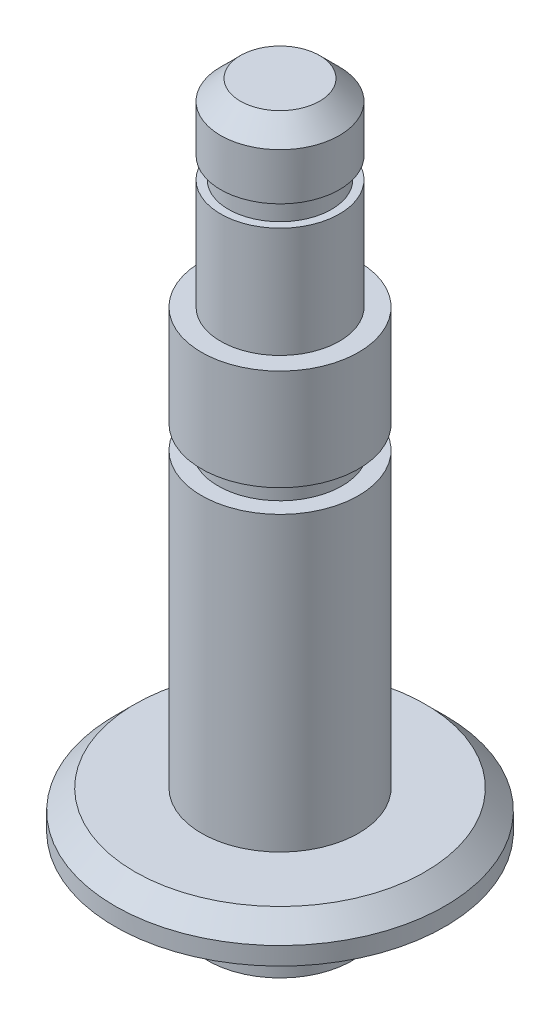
ISO-10303-21;
HEADER;
FILE_DESCRIPTION(('STEP AP214'),'2;1');
FILE_NAME('part.step','',(''),(''),'','','');
FILE_SCHEMA(('AUTOMOTIVE_DESIGN { 1 0 10303 214 1 1 1 1 }'));
ENDSEC;
DATA;
#1=APPLICATION_CONTEXT('core data for automotive mechanical design processes');
#2=APPLICATION_PROTOCOL_DEFINITION('international standard','automotive_design',2000,#1);
#3=PRODUCT_CONTEXT('',#1,'mechanical');
#4=PRODUCT('Part','Part','',(#3));
#5=PRODUCT_RELATED_PRODUCT_CATEGORY('part','',(#4));
#6=PRODUCT_DEFINITION_FORMATION('','',#4);
#7=PRODUCT_DEFINITION_CONTEXT('part definition',#1,'design');
#8=PRODUCT_DEFINITION('design','',#6,#7);
#9=PRODUCT_DEFINITION_SHAPE('','',#8);
#10=(LENGTH_UNIT() NAMED_UNIT(*) SI_UNIT(.MILLI.,.METRE.));
#11=(NAMED_UNIT(*) PLANE_ANGLE_UNIT() SI_UNIT($,.RADIAN.));
#12=(NAMED_UNIT(*) SI_UNIT($,.STERADIAN.) SOLID_ANGLE_UNIT());
#13=UNCERTAINTY_MEASURE_WITH_UNIT(LENGTH_MEASURE(1.E-05),#10,'distance_accuracy_value','');
#14=(GEOMETRIC_REPRESENTATION_CONTEXT(3) GLOBAL_UNCERTAINTY_ASSIGNED_CONTEXT((#13)) GLOBAL_UNIT_ASSIGNED_CONTEXT((#10,
#11,#12)) REPRESENTATION_CONTEXT('',''));
#15=CARTESIAN_POINT('',(0.,0.,0.));
#16=DIRECTION('',(0.,0.,1.));
#17=DIRECTION('',(1.,0.,0.));
#18=AXIS2_PLACEMENT_3D('',#15,#16,#17);
#19=CARTESIAN_POINT('',(0.,0.,0.));
#20=DIRECTION('',(0.,-1.,0.));
#21=DIRECTION('',(0.,0.,-1.));
#22=AXIS2_PLACEMENT_3D('',#19,#20,#21);
#23=CYLINDRICAL_SURFACE('',#22,2.286);
#24=CARTESIAN_POINT('',(0.,21.717,0.));
#25=DIRECTION('',(0.,-1.,0.));
#26=DIRECTION('',(0.,0.,-1.));
#27=AXIS2_PLACEMENT_3D('',#24,#25,#26);
#28=CIRCLE('',#27,2.286);
#29=CARTESIAN_POINT('',(0.,21.717,-2.286));
#30=VERTEX_POINT('',#29);
#31=EDGE_CURVE('E80',#30,#30,#28,.T.);
#32=ORIENTED_EDGE('',*,*,#31,.T.);
#33=EDGE_LOOP('',(#32));
#34=FACE_BOUND('',#33,.T.);
#35=CARTESIAN_POINT('',(0.,17.4752,0.));
#36=DIRECTION('',(0.,-1.,0.));
#37=DIRECTION('',(0.,0.,-1.));
#38=AXIS2_PLACEMENT_3D('',#35,#36,#37);
#39=CIRCLE('',#38,2.286);
#40=CARTESIAN_POINT('',(0.,17.4752,-2.286));
#41=VERTEX_POINT('',#40);
#42=EDGE_CURVE('E62',#41,#41,#39,.T.);
#43=ORIENTED_EDGE('',*,*,#42,.F.);
#44=EDGE_LOOP('',(#43));
#45=FACE_BOUND('',#44,.T.);
#46=ADVANCED_FACE('F30',(#34,#45),#23,.T.);
#47=CARTESIAN_POINT('',(0.,0.,0.));
#48=DIRECTION('',(0.,-1.,0.));
#49=DIRECTION('',(0.,0.,-1.));
#50=AXIS2_PLACEMENT_3D('',#47,#48,#49);
#51=CYLINDRICAL_SURFACE('',#50,3.0226);
#52=CARTESIAN_POINT('',(0.,12.7,0.));
#53=DIRECTION('',(0.,-1.,0.));
#54=DIRECTION('',(0.,0.,-1.));
#55=AXIS2_PLACEMENT_3D('',#52,#53,#54);
#56=CIRCLE('',#55,3.0226);
#57=CARTESIAN_POINT('',(0.,12.7,-3.0226));
#58=VERTEX_POINT('',#57);
#59=EDGE_CURVE('E68',#58,#58,#56,.T.);
#60=ORIENTED_EDGE('',*,*,#59,.T.);
#61=EDGE_LOOP('',(#60));
#62=FACE_BOUND('',#61,.T.);
#63=CARTESIAN_POINT('',(0.,1.4478,0.));
#64=DIRECTION('',(0.,-1.,0.));
#65=DIRECTION('',(0.,0.,-1.));
#66=AXIS2_PLACEMENT_3D('',#63,#64,#65);
#67=CIRCLE('',#66,3.0226);
#68=CARTESIAN_POINT('',(0.,1.4478,-3.0226));
#69=VERTEX_POINT('',#68);
#70=EDGE_CURVE('E56',#69,#69,#67,.T.);
#71=ORIENTED_EDGE('',*,*,#70,.F.);
#72=EDGE_LOOP('',(#71));
#73=FACE_BOUND('',#72,.T.);
#74=ADVANCED_FACE('F106',(#62,#73),#51,.T.);
#75=CARTESIAN_POINT('',(0.,0.,0.));
#76=DIRECTION('',(0.,-1.,0.));
#77=DIRECTION('',(0.,0.,-1.));
#78=AXIS2_PLACEMENT_3D('',#75,#76,#77);
#79=CYLINDRICAL_SURFACE('',#78,2.778125);
#80=CARTESIAN_POINT('',(0.,0.,0.));
#81=DIRECTION('',(0.,-1.,0.));
#82=DIRECTION('',(0.,0.,-1.));
#83=AXIS2_PLACEMENT_3D('',#80,#81,#82);
#84=CIRCLE('',#83,2.778125);
#85=CARTESIAN_POINT('',(0.,0.,-2.778125));
#86=VERTEX_POINT('',#85);
#87=EDGE_CURVE('E50',#86,#86,#84,.T.);
#88=ORIENTED_EDGE('',*,*,#87,.T.);
#89=EDGE_LOOP('',(#88));
#90=FACE_BOUND('',#89,.T.);
#91=CARTESIAN_POINT('',(0.,-2.921,0.));
#92=DIRECTION('',(0.,-1.,0.));
#93=DIRECTION('',(0.,0.,-1.));
#94=AXIS2_PLACEMENT_3D('',#91,#92,#93);
#95=CIRCLE('',#94,2.778125);
#96=CARTESIAN_POINT('',(0.,-2.921,-2.778125));
#97=VERTEX_POINT('',#96);
#98=EDGE_CURVE('E65',#97,#97,#95,.T.);
#99=ORIENTED_EDGE('',*,*,#98,.F.);
#100=EDGE_LOOP('',(#99));
#101=FACE_BOUND('',#100,.T.);
#102=ADVANCED_FACE('F111',(#90,#101),#79,.T.);
#103=CARTESIAN_POINT('',(0.,0.,-2.778125));
#104=DIRECTION('',(0.,-1.,0.));
#105=DIRECTION('',(0.,0.,-1.));
#106=AXIS2_PLACEMENT_3D('',#103,#104,#105);
#107=PLANE('',#106);
#108=CARTESIAN_POINT('',(0.,0.,0.));
#109=DIRECTION('',(0.,-1.,0.));
#110=DIRECTION('',(0.,0.,-1.));
#111=AXIS2_PLACEMENT_3D('',#108,#109,#110);
#112=CIRCLE('',#111,6.35);
#113=CARTESIAN_POINT('',(0.,0.,-6.35));
#114=VERTEX_POINT('',#113);
#115=EDGE_CURVE('E53',#114,#114,#112,.T.);
#116=ORIENTED_EDGE('',*,*,#115,.T.);
#117=EDGE_LOOP('',(#116));
#118=FACE_BOUND('',#117,.T.);
#119=ORIENTED_EDGE('',*,*,#87,.F.);
#120=EDGE_LOOP('',(#119));
#121=FACE_BOUND('',#120,.T.);
#122=ADVANCED_FACE('F144',(#118,#121),#107,.T.);
#123=CARTESIAN_POINT('',(0.,0.,0.));
#124=DIRECTION('',(0.,-1.,0.));
#125=DIRECTION('',(0.,0.,-1.));
#126=AXIS2_PLACEMENT_3D('',#123,#124,#125);
#127=CYLINDRICAL_SURFACE('',#126,6.35);
#128=CARTESIAN_POINT('',(0.,0.685800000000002,0.));
#129=DIRECTION('',(0.,1.,0.));
#130=DIRECTION('',(0.,0.,1.));
#131=AXIS2_PLACEMENT_3D('',#128,#129,#130);
#132=CIRCLE('',#131,6.35);
#133=CARTESIAN_POINT('',(0.,0.685800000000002,6.35));
#134=VERTEX_POINT('',#133);
#135=EDGE_CURVE('E45',#134,#134,#132,.F.);
#136=ORIENTED_EDGE('',*,*,#135,.T.);
#137=EDGE_LOOP('',(#136));
#138=FACE_BOUND('',#137,.T.);
#139=ORIENTED_EDGE('',*,*,#115,.F.);
#140=EDGE_LOOP('',(#139));
#141=FACE_BOUND('',#140,.T.);
#142=ADVANCED_FACE('F140',(#138,#141),#127,.T.);
#143=CARTESIAN_POINT('',(0.,1.4478,-6.35));
#144=DIRECTION('',(0.,1.,0.));
#145=DIRECTION('',(0.,0.,1.));
#146=AXIS2_PLACEMENT_3D('',#143,#144,#145);
#147=PLANE('',#146);
#148=CARTESIAN_POINT('',(0.,1.4478,0.));
#149=DIRECTION('',(0.,1.,0.));
#150=DIRECTION('',(0.,0.,1.));
#151=AXIS2_PLACEMENT_3D('',#148,#149,#150);
#152=CIRCLE('',#151,5.588);
#153=CARTESIAN_POINT('',(0.,1.4478,5.588));
#154=VERTEX_POINT('',#153);
#155=EDGE_CURVE('E41',#154,#154,#152,.T.);
#156=ORIENTED_EDGE('',*,*,#155,.T.);
#157=EDGE_LOOP('',(#156));
#158=FACE_BOUND('',#157,.T.);
#159=ORIENTED_EDGE('',*,*,#70,.T.);
#160=EDGE_LOOP('',(#159));
#161=FACE_BOUND('',#160,.T.);
#162=ADVANCED_FACE('F136',(#158,#161),#147,.T.);
#163=CARTESIAN_POINT('',(0.,-2.921,0.));
#164=DIRECTION('',(0.,-1.,0.));
#165=DIRECTION('',(0.,0.,-1.));
#166=AXIS2_PLACEMENT_3D('',#163,#164,#165);
#167=PLANE('',#166);
#168=ORIENTED_EDGE('',*,*,#98,.T.);
#169=EDGE_LOOP('',(#168));
#170=FACE_BOUND('',#169,.T.);
#171=ADVANCED_FACE('F139',(#170),#167,.T.);
#172=CARTESIAN_POINT('',(0.,0.685800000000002,0.));
#173=DIRECTION('',(0.,-1.,0.));
#174=DIRECTION('',(0.,0.,-1.));
#175=AXIS2_PLACEMENT_3D('',#172,#173,#174);
#176=CONICAL_SURFACE('',#175,6.35,0.78539816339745);
#177=ORIENTED_EDGE('',*,*,#155,.F.);
#178=EDGE_LOOP('',(#177));
#179=FACE_BOUND('',#178,.T.);
#180=ORIENTED_EDGE('',*,*,#135,.F.);
#181=EDGE_LOOP('',(#180));
#182=FACE_BOUND('',#181,.T.);
#183=ADVANCED_FACE('F151',(#179,#182),#176,.T.);
#184=CARTESIAN_POINT('',(0.,12.7,-3.0226));
#185=DIRECTION('',(0.,-1.,0.));
#186=DIRECTION('',(0.,0.,-1.));
#187=AXIS2_PLACEMENT_3D('',#184,#185,#186);
#188=PLANE('',#187);
#189=ORIENTED_EDGE('',*,*,#59,.F.);
#190=EDGE_LOOP('',(#189));
#191=FACE_BOUND('',#190,.T.);
#192=CARTESIAN_POINT('',(0.,12.7,0.));
#193=DIRECTION('',(0.,-1.,0.));
#194=DIRECTION('',(0.,0.,-1.));
#195=AXIS2_PLACEMENT_3D('',#192,#193,#194);
#196=CIRCLE('',#195,2.38125);
#197=CARTESIAN_POINT('',(0.,12.7,-2.38125));
#198=VERTEX_POINT('',#197);
#199=EDGE_CURVE('E71',#198,#198,#196,.T.);
#200=ORIENTED_EDGE('',*,*,#199,.T.);
#201=EDGE_LOOP('',(#200));
#202=FACE_BOUND('',#201,.T.);
#203=ADVANCED_FACE('F153',(#191,#202),#188,.F.);
#204=CARTESIAN_POINT('',(0.,0.,0.));
#205=DIRECTION('',(0.,-1.,0.));
#206=DIRECTION('',(0.,0.,-1.));
#207=AXIS2_PLACEMENT_3D('',#204,#205,#206);
#208=CYLINDRICAL_SURFACE('',#207,2.38125);
#209=ORIENTED_EDGE('',*,*,#199,.F.);
#210=EDGE_LOOP('',(#209));
#211=FACE_BOUND('',#210,.T.);
#212=CARTESIAN_POINT('',(0.,13.589,0.));
#213=DIRECTION('',(0.,-1.,0.));
#214=DIRECTION('',(0.,0.,-1.));
#215=AXIS2_PLACEMENT_3D('',#212,#213,#214);
#216=CIRCLE('',#215,2.38125);
#217=CARTESIAN_POINT('',(0.,13.589,-2.38125));
#218=VERTEX_POINT('',#217);
#219=EDGE_CURVE('E74',#218,#218,#216,.T.);
#220=ORIENTED_EDGE('',*,*,#219,.T.);
#221=EDGE_LOOP('',(#220));
#222=FACE_BOUND('',#221,.T.);
#223=ADVANCED_FACE('F159',(#211,#222),#208,.T.);
#224=CARTESIAN_POINT('',(0.,13.589,-3.0226));
#225=DIRECTION('',(0.,1.,0.));
#226=DIRECTION('',(0.,0.,1.));
#227=AXIS2_PLACEMENT_3D('',#224,#225,#226);
#228=PLANE('',#227);
#229=ORIENTED_EDGE('',*,*,#219,.F.);
#230=EDGE_LOOP('',(#229));
#231=FACE_BOUND('',#230,.T.);
#232=CARTESIAN_POINT('',(0.,13.589,0.));
#233=DIRECTION('',(0.,-1.,0.));
#234=DIRECTION('',(0.,0.,-1.));
#235=AXIS2_PLACEMENT_3D('',#232,#233,#234);
#236=CIRCLE('',#235,3.0226);
#237=CARTESIAN_POINT('',(0.,13.589,-3.0226));
#238=VERTEX_POINT('',#237);
#239=EDGE_CURVE('E77',#238,#238,#236,.T.);
#240=ORIENTED_EDGE('',*,*,#239,.T.);
#241=EDGE_LOOP('',(#240));
#242=FACE_BOUND('',#241,.T.);
#243=ADVANCED_FACE('F122',(#231,#242),#228,.F.);
#244=CARTESIAN_POINT('',(0.,17.4752,-3.0226));
#245=DIRECTION('',(0.,1.,0.));
#246=DIRECTION('',(0.,0.,1.));
#247=AXIS2_PLACEMENT_3D('',#244,#245,#246);
#248=PLANE('',#247);
#249=ORIENTED_EDGE('',*,*,#42,.T.);
#250=EDGE_LOOP('',(#249));
#251=FACE_BOUND('',#250,.T.);
#252=CARTESIAN_POINT('',(0.,17.4752,0.));
#253=DIRECTION('',(0.,-1.,0.));
#254=DIRECTION('',(0.,0.,-1.));
#255=AXIS2_PLACEMENT_3D('',#252,#253,#254);
#256=CIRCLE('',#255,3.0226);
#257=CARTESIAN_POINT('',(0.,17.4752,-3.0226));
#258=VERTEX_POINT('',#257);
#259=EDGE_CURVE('E59',#258,#258,#256,.T.);
#260=ORIENTED_EDGE('',*,*,#259,.F.);
#261=EDGE_LOOP('',(#260));
#262=FACE_BOUND('',#261,.T.);
#263=ADVANCED_FACE('F119',(#251,#262),#248,.T.);
#264=ORIENTED_EDGE('',*,*,#239,.F.);
#265=EDGE_LOOP('',(#264));
#266=FACE_BOUND('',#265,.T.);
#267=ORIENTED_EDGE('',*,*,#259,.T.);
#268=EDGE_LOOP('',(#267));
#269=FACE_BOUND('',#268,.T.);
#270=ADVANCED_FACE('F114',(#266,#269),#51,.T.);
#271=CARTESIAN_POINT('',(0.,21.717,-2.286));
#272=DIRECTION('',(0.,-1.,0.));
#273=DIRECTION('',(0.,0.,-1.));
#274=AXIS2_PLACEMENT_3D('',#271,#272,#273);
#275=PLANE('',#274);
#276=ORIENTED_EDGE('',*,*,#31,.F.);
#277=EDGE_LOOP('',(#276));
#278=FACE_BOUND('',#277,.T.);
#279=CARTESIAN_POINT('',(0.,21.717,0.));
#280=DIRECTION('',(0.,-1.,0.));
#281=DIRECTION('',(0.,0.,-1.));
#282=AXIS2_PLACEMENT_3D('',#279,#280,#281);
#283=CIRCLE('',#282,1.9812);
#284=CARTESIAN_POINT('',(0.,21.717,-1.9812));
#285=VERTEX_POINT('',#284);
#286=EDGE_CURVE('E83',#285,#285,#283,.T.);
#287=ORIENTED_EDGE('',*,*,#286,.T.);
#288=EDGE_LOOP('',(#287));
#289=FACE_BOUND('',#288,.T.);
#290=ADVANCED_FACE('F126',(#278,#289),#275,.F.);
#291=CARTESIAN_POINT('',(0.,0.,0.));
#292=DIRECTION('',(0.,-1.,0.));
#293=DIRECTION('',(0.,0.,-1.));
#294=AXIS2_PLACEMENT_3D('',#291,#292,#293);
#295=CYLINDRICAL_SURFACE('',#294,1.9812);
#296=ORIENTED_EDGE('',*,*,#286,.F.);
#297=EDGE_LOOP('',(#296));
#298=FACE_BOUND('',#297,.T.);
#299=CARTESIAN_POINT('',(0.,22.5268698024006,0.));
#300=DIRECTION('',(0.,-1.,0.));
#301=DIRECTION('',(0.,0.,-1.));
#302=AXIS2_PLACEMENT_3D('',#299,#300,#301);
#303=CIRCLE('',#302,1.9812);
#304=CARTESIAN_POINT('',(0.,22.5268698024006,-1.9812));
#305=VERTEX_POINT('',#304);
#306=EDGE_CURVE('E86',#305,#305,#303,.T.);
#307=ORIENTED_EDGE('',*,*,#306,.T.);
#308=EDGE_LOOP('',(#307));
#309=FACE_BOUND('',#308,.T.);
#310=ADVANCED_FACE('F131',(#298,#309),#295,.T.);
#311=CARTESIAN_POINT('',(0.,22.5268698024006,-2.286));
#312=DIRECTION('',(0.,1.,0.));
#313=DIRECTION('',(0.,0.,1.));
#314=AXIS2_PLACEMENT_3D('',#311,#312,#313);
#315=PLANE('',#314);
#316=ORIENTED_EDGE('',*,*,#306,.F.);
#317=EDGE_LOOP('',(#316));
#318=FACE_BOUND('',#317,.T.);
#319=CARTESIAN_POINT('',(0.,22.5268698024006,0.));
#320=DIRECTION('',(0.,-1.,0.));
#321=DIRECTION('',(0.,0.,-1.));
#322=AXIS2_PLACEMENT_3D('',#319,#320,#321);
#323=CIRCLE('',#322,2.286);
#324=CARTESIAN_POINT('',(0.,22.5268698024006,-2.286));
#325=VERTEX_POINT('',#324);
#326=EDGE_CURVE('E89',#325,#325,#323,.T.);
#327=ORIENTED_EDGE('',*,*,#326,.T.);
#328=EDGE_LOOP('',(#327));
#329=FACE_BOUND('',#328,.T.);
#330=ADVANCED_FACE('F93',(#318,#329),#315,.F.);
#331=CARTESIAN_POINT('',(0.,25.0952,-2.286));
#332=DIRECTION('',(0.,1.,0.));
#333=DIRECTION('',(0.,0.,1.));
#334=AXIS2_PLACEMENT_3D('',#331,#332,#333);
#335=PLANE('',#334);
#336=CARTESIAN_POINT('',(0.,25.0952,0.));
#337=DIRECTION('',(0.,1.,0.));
#338=DIRECTION('',(0.,0.,1.));
#339=AXIS2_PLACEMENT_3D('',#336,#337,#338);
#340=CIRCLE('',#339,1.52399999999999);
#341=CARTESIAN_POINT('',(0.,25.0952,1.52399999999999));
#342=VERTEX_POINT('',#341);
#343=EDGE_CURVE('E10',#342,#342,#340,.T.);
#344=ORIENTED_EDGE('',*,*,#343,.T.);
#345=EDGE_LOOP('',(#344));
#346=FACE_BOUND('',#345,.T.);
#347=ADVANCED_FACE('F101',(#346),#335,.T.);
#348=CARTESIAN_POINT('',(0.,24.3332,0.));
#349=DIRECTION('',(0.,-1.,0.));
#350=DIRECTION('',(0.,0.,-1.));
#351=AXIS2_PLACEMENT_3D('',#348,#349,#350);
#352=CONICAL_SURFACE('',#351,2.286,0.785398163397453);
#353=ORIENTED_EDGE('',*,*,#343,.F.);
#354=EDGE_LOOP('',(#353));
#355=FACE_BOUND('',#354,.T.);
#356=CARTESIAN_POINT('',(0.,24.3332,0.));
#357=DIRECTION('',(0.,1.,0.));
#358=DIRECTION('',(0.,0.,1.));
#359=AXIS2_PLACEMENT_3D('',#356,#357,#358);
#360=CIRCLE('',#359,2.286);
#361=CARTESIAN_POINT('',(0.,24.3332,2.286));
#362=VERTEX_POINT('',#361);
#363=EDGE_CURVE('E37',#362,#362,#360,.F.);
#364=ORIENTED_EDGE('',*,*,#363,.F.);
#365=EDGE_LOOP('',(#364));
#366=FACE_BOUND('',#365,.T.);
#367=ADVANCED_FACE('F32',(#355,#366),#352,.T.);
#368=ORIENTED_EDGE('',*,*,#326,.F.);
#369=EDGE_LOOP('',(#368));
#370=FACE_BOUND('',#369,.T.);
#371=ORIENTED_EDGE('',*,*,#363,.T.);
#372=EDGE_LOOP('',(#371));
#373=FACE_BOUND('',#372,.T.);
#374=ADVANCED_FACE('F95',(#370,#373),#23,.T.);
#375=CLOSED_SHELL('',(#46,#74,#102,#122,#142,#162,#171,#183,#203,#223,#243,#263,#270,#290,#310,
#330,#347,#367,#374));
#376=MANIFOLD_SOLID_BREP('B2',#375);
#377=ADVANCED_BREP_SHAPE_REPRESENTATION('',(#18,#376),#14);
#378=SHAPE_DEFINITION_REPRESENTATION(#9,#377);
ENDSEC;
END-ISO-10303-21;
